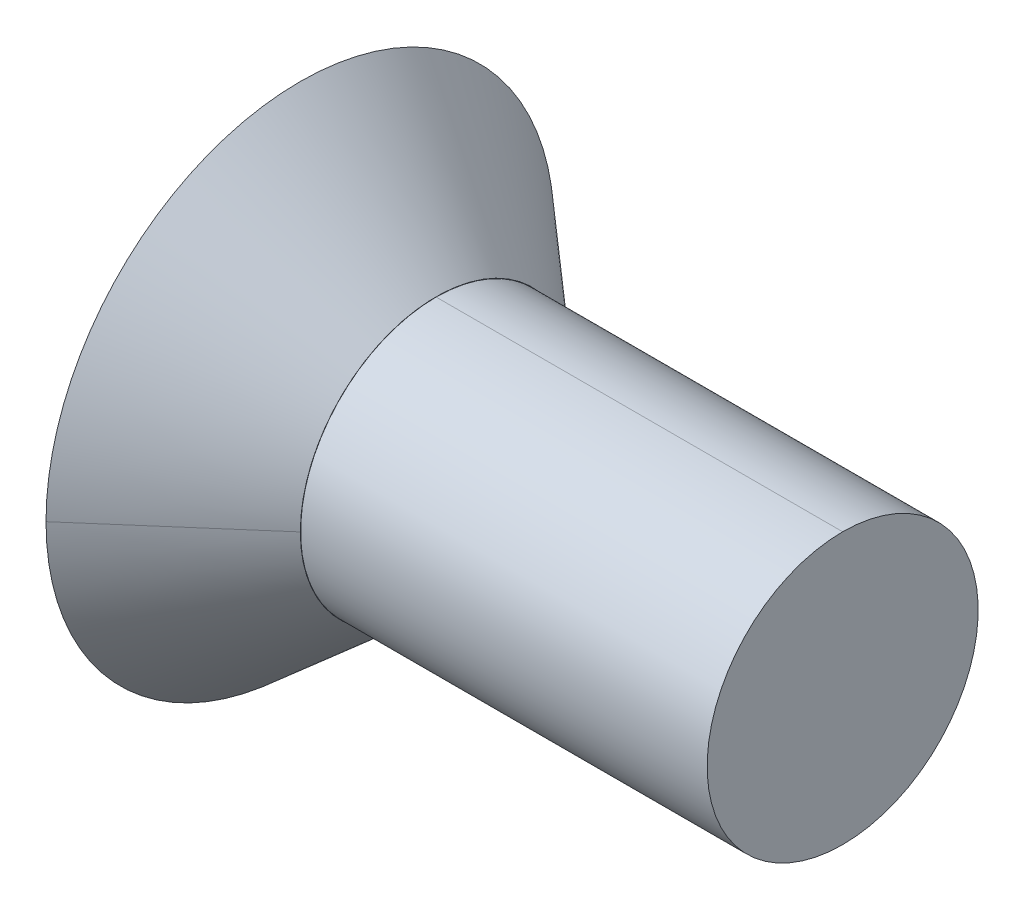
ISO-10303-21;
HEADER;
FILE_DESCRIPTION(('STEP AP214'),'2;1');
FILE_NAME('part.step','',(''),(''),'','','');
FILE_SCHEMA(('AUTOMOTIVE_DESIGN { 1 0 10303 214 1 1 1 1 }'));
ENDSEC;
DATA;
#1=APPLICATION_CONTEXT('core data for automotive mechanical design processes');
#2=APPLICATION_PROTOCOL_DEFINITION('international standard','automotive_design',2000,#1);
#3=PRODUCT_CONTEXT('',#1,'mechanical');
#4=PRODUCT('Part','Part','',(#3));
#5=PRODUCT_RELATED_PRODUCT_CATEGORY('part','',(#4));
#6=PRODUCT_DEFINITION_FORMATION('','',#4);
#7=PRODUCT_DEFINITION_CONTEXT('part definition',#1,'design');
#8=PRODUCT_DEFINITION('design','',#6,#7);
#9=PRODUCT_DEFINITION_SHAPE('','',#8);
#10=(LENGTH_UNIT() NAMED_UNIT(*) SI_UNIT(.MILLI.,.METRE.));
#11=(NAMED_UNIT(*) PLANE_ANGLE_UNIT() SI_UNIT($,.RADIAN.));
#12=(NAMED_UNIT(*) SI_UNIT($,.STERADIAN.) SOLID_ANGLE_UNIT());
#13=UNCERTAINTY_MEASURE_WITH_UNIT(LENGTH_MEASURE(1.E-05),#10,'distance_accuracy_value','');
#14=(GEOMETRIC_REPRESENTATION_CONTEXT(3) GLOBAL_UNCERTAINTY_ASSIGNED_CONTEXT((#13)) GLOBAL_UNIT_ASSIGNED_CONTEXT((#10,
#11,#12)) REPRESENTATION_CONTEXT('',''));
#15=CARTESIAN_POINT('',(0.,0.,0.));
#16=DIRECTION('',(0.,0.,1.));
#17=DIRECTION('',(1.,0.,0.));
#18=AXIS2_PLACEMENT_3D('',#15,#16,#17);
#19=CARTESIAN_POINT('',(12.7127000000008,0.,0.));
#20=DIRECTION('',(-1.,0.,0.));
#21=DIRECTION('',(0.,0.,1.));
#22=AXIS2_PLACEMENT_3D('',#19,#20,#21);
#23=PLANE('',#22);
#24=CARTESIAN_POINT('',(12.7127000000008,0.,1.80477854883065E-13));
#25=DIRECTION('',(1.,0.,0.));
#26=DIRECTION('',(0.,1.,0.));
#27=AXIS2_PLACEMENT_3D('',#24,#25,#26);
#28=CIRCLE('',#27,6.35);
#29=CARTESIAN_POINT('',(12.7127000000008,-6.35,1.81255479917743E-13));
#30=VERTEX_POINT('',#29);
#31=CARTESIAN_POINT('',(12.7127000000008,6.35,1.79700229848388E-13));
#32=VERTEX_POINT('',#31);
#33=EDGE_CURVE('E67',#30,#32,#28,.F.);
#34=ORIENTED_EDGE('',*,*,#33,.F.);
#35=CARTESIAN_POINT('',(12.7127000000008,0.,1.80477854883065E-13));
#36=DIRECTION('',(1.,0.,0.));
#37=DIRECTION('',(0.,1.,0.));
#38=AXIS2_PLACEMENT_3D('',#35,#36,#37);
#39=CIRCLE('',#38,6.35);
#40=EDGE_CURVE('E19',#32,#30,#39,.F.);
#41=ORIENTED_EDGE('',*,*,#40,.F.);
#42=EDGE_LOOP('',(#34,#41));
#43=FACE_BOUND('',#42,.T.);
#44=ADVANCED_FACE('F16',(#43),#23,.F.);
#45=CARTESIAN_POINT('',(6.36270000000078,0.,1.80477854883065E-13));
#46=DIRECTION('',(1.,0.,0.));
#47=DIRECTION('',(0.,1.,0.));
#48=AXIS2_PLACEMENT_3D('',#45,#46,#47);
#49=CYLINDRICAL_SURFACE('',#48,6.35);
#50=DIRECTION('',(1.,0.,0.));
#51=VECTOR('',#50,1.);
#52=CARTESIAN_POINT('',(6.36270000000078,6.35,1.80477854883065E-13));
#53=LINE('',#52,#51);
#54=CARTESIAN_POINT('',(-6.33729999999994,6.35,1.79700229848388E-13));
#55=VERTEX_POINT('',#54);
#56=EDGE_CURVE('E65',#32,#55,#53,.F.);
#57=ORIENTED_EDGE('',*,*,#56,.F.);
#58=ORIENTED_EDGE('',*,*,#40,.T.);
#59=DIRECTION('',(1.,0.,0.));
#60=VECTOR('',#59,1.);
#61=CARTESIAN_POINT('',(6.36270000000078,-6.35,1.81255479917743E-13));
#62=LINE('',#61,#60);
#63=CARTESIAN_POINT('',(-6.33729999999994,-6.35,1.81255479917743E-13));
#64=VERTEX_POINT('',#63);
#65=EDGE_CURVE('E62',#64,#30,#62,.T.);
#66=ORIENTED_EDGE('',*,*,#65,.F.);
#67=CARTESIAN_POINT('',(-6.33729999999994,0.,1.80477854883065E-13));
#68=DIRECTION('',(1.,0.,0.));
#69=DIRECTION('',(0.,1.,0.));
#70=AXIS2_PLACEMENT_3D('',#67,#68,#69);
#71=CIRCLE('',#70,6.35);
#72=EDGE_CURVE('E90',#55,#64,#71,.F.);
#73=ORIENTED_EDGE('',*,*,#72,.F.);
#74=EDGE_LOOP('',(#57,#58,#66,#73));
#75=FACE_BOUND('',#74,.T.);
#76=ADVANCED_FACE('F60',(#75),#49,.T.);
#77=CARTESIAN_POINT('',(6.36270000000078,0.,1.80477854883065E-13));
#78=DIRECTION('',(1.,0.,0.));
#79=DIRECTION('',(0.,1.,0.));
#80=AXIS2_PLACEMENT_3D('',#77,#78,#79);
#81=CYLINDRICAL_SURFACE('',#80,6.35);
#82=ORIENTED_EDGE('',*,*,#56,.T.);
#83=CARTESIAN_POINT('',(-6.33729999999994,0.,1.80477854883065E-13));
#84=DIRECTION('',(1.,0.,0.));
#85=DIRECTION('',(0.,1.,0.));
#86=AXIS2_PLACEMENT_3D('',#83,#84,#85);
#87=CIRCLE('',#86,6.35);
#88=EDGE_CURVE('E71',#64,#55,#87,.F.);
#89=ORIENTED_EDGE('',*,*,#88,.F.);
#90=ORIENTED_EDGE('',*,*,#65,.T.);
#91=ORIENTED_EDGE('',*,*,#33,.T.);
#92=EDGE_LOOP('',(#82,#89,#90,#91));
#93=FACE_BOUND('',#92,.T.);
#94=ADVANCED_FACE('F69',(#93),#81,.T.);
#95=CARTESIAN_POINT('',(-6.36270000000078,-3.60250718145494E-13,0.));
#96=DIRECTION('',(1.,0.,0.));
#97=DIRECTION('',(0.,0.,-1.));
#98=AXIS2_PLACEMENT_3D('',#95,#96,#97);
#99=PLANE('',#98);
#100=DIRECTION('',(0.,1.,0.));
#101=VECTOR('',#100,1.);
#102=CARTESIAN_POINT('',(-6.36270000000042,-2.29135888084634,3.96875));
#103=LINE('',#102,#101);
#104=CARTESIAN_POINT('',(-6.3627000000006,-2.29135888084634,3.96875));
#105=VERTEX_POINT('',#104);
#106=CARTESIAN_POINT('',(-6.36270000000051,2.29135888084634,3.96875));
#107=VERTEX_POINT('',#106);
#108=EDGE_CURVE('E89',#105,#107,#103,.T.);
#109=ORIENTED_EDGE('',*,*,#108,.T.);
#110=DIRECTION('',(0.,-0.500000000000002,0.866025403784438));
#111=VECTOR('',#110,1.);
#112=CARTESIAN_POINT('',(-6.36270000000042,2.29135888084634,3.96875));
#113=LINE('',#112,#111);
#114=CARTESIAN_POINT('',(-6.3627000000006,4.58271776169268,0.));
#115=VERTEX_POINT('',#114);
#116=EDGE_CURVE('E110',#107,#115,#113,.F.);
#117=ORIENTED_EDGE('',*,*,#116,.T.);
#118=DIRECTION('',(0.,0.500000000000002,0.866025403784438));
#119=VECTOR('',#118,1.);
#120=CARTESIAN_POINT('',(-6.36270000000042,4.58271776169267,0.));
#121=LINE('',#120,#119);
#122=CARTESIAN_POINT('',(-6.3627000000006,2.29135888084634,-3.96875));
#123=VERTEX_POINT('',#122);
#124=EDGE_CURVE('E119',#115,#123,#121,.F.);
#125=ORIENTED_EDGE('',*,*,#124,.T.);
#126=DIRECTION('',(0.,1.,0.));
#127=VECTOR('',#126,1.);
#128=CARTESIAN_POINT('',(-6.36270000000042,2.29135888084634,-3.96875));
#129=LINE('',#128,#127);
#130=CARTESIAN_POINT('',(-6.3627000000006,-2.29135888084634,-3.96875));
#131=VERTEX_POINT('',#130);
#132=EDGE_CURVE('E125',#123,#131,#129,.F.);
#133=ORIENTED_EDGE('',*,*,#132,.T.);
#134=DIRECTION('',(0.,0.500000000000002,-0.866025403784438));
#135=VECTOR('',#134,1.);
#136=CARTESIAN_POINT('',(-6.36270000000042,-2.29135888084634,-3.96875));
#137=LINE('',#136,#135);
#138=CARTESIAN_POINT('',(-6.3627000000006,-4.58271776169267,0.));
#139=VERTEX_POINT('',#138);
#140=EDGE_CURVE('E131',#131,#139,#137,.F.);
#141=ORIENTED_EDGE('',*,*,#140,.T.);
#142=DIRECTION('',(0.,-0.500000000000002,-0.866025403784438));
#143=VECTOR('',#142,1.);
#144=CARTESIAN_POINT('',(-6.36270000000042,-4.58271776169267,0.));
#145=LINE('',#144,#143);
#146=EDGE_CURVE('E137',#139,#105,#145,.F.);
#147=ORIENTED_EDGE('',*,*,#146,.T.);
#148=EDGE_LOOP('',(#109,#117,#125,#133,#141,#147));
#149=FACE_BOUND('',#148,.T.);
#150=ADVANCED_FACE('F96',(#149),#99,.F.);
#151=CARTESIAN_POINT('',(-6.33729999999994,0.,3.18209966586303));
#152=DIRECTION('',(1.,0.,0.));
#153=DIRECTION('',(0.,0.,-1.));
#154=AXIS2_PLACEMENT_3D('',#151,#152,#153);
#155=PLANE('',#154);
#156=ORIENTED_EDGE('',*,*,#72,.T.);
#157=ORIENTED_EDGE('',*,*,#88,.T.);
#158=EDGE_LOOP('',(#156,#157));
#159=FACE_BOUND('',#158,.T.);
#160=CARTESIAN_POINT('',(-6.33729999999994,0.,0.));
#161=DIRECTION('',(-1.,0.,0.));
#162=DIRECTION('',(0.,-1.,0.));
#163=AXIS2_PLACEMENT_3D('',#160,#161,#162);
#164=CIRCLE('',#163,6.36419933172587);
#165=CARTESIAN_POINT('',(-6.33729999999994,0.,6.36419933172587));
#166=VERTEX_POINT('',#165);
#167=CARTESIAN_POINT('',(-6.33729999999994,0.,-6.36419933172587));
#168=VERTEX_POINT('',#167);
#169=EDGE_CURVE('E84',#166,#168,#164,.T.);
#170=ORIENTED_EDGE('',*,*,#169,.F.);
#171=CARTESIAN_POINT('',(-6.33729999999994,0.,0.));
#172=DIRECTION('',(-1.,0.,0.));
#173=DIRECTION('',(0.,-1.,0.));
#174=AXIS2_PLACEMENT_3D('',#171,#172,#173);
#175=CIRCLE('',#174,6.36419933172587);
#176=EDGE_CURVE('E80',#168,#166,#175,.T.);
#177=ORIENTED_EDGE('',*,*,#176,.F.);
#178=EDGE_LOOP('',(#170,#177));
#179=FACE_BOUND('',#178,.T.);
#180=ADVANCED_FACE('F92',(#159,#179),#155,.T.);
#181=CARTESIAN_POINT('',(-6.36270000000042,-2.29135888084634,3.96875));
#182=DIRECTION('',(0.,0.,1.));
#183=DIRECTION('',(1.,0.,0.));
#184=AXIS2_PLACEMENT_3D('',#181,#182,#183);
#185=PLANE('',#184);
#186=DIRECTION('',(1.,0.,0.));
#187=VECTOR('',#186,1.);
#188=CARTESIAN_POINT('',(-6.36270000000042,2.29135888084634,3.96875));
#189=LINE('',#188,#187);
#190=CARTESIAN_POINT('',(-12.7127000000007,2.29135888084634,3.96875));
#191=VERTEX_POINT('',#190);
#192=EDGE_CURVE('E113',#191,#107,#189,.T.);
#193=ORIENTED_EDGE('',*,*,#192,.T.);
#194=ORIENTED_EDGE('',*,*,#108,.F.);
#195=DIRECTION('',(1.,0.,0.));
#196=VECTOR('',#195,1.);
#197=CARTESIAN_POINT('',(-6.36270000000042,-2.29135888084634,3.96875));
#198=LINE('',#197,#196);
#199=CARTESIAN_POINT('',(-12.7127000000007,-2.29135888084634,3.96875));
#200=VERTEX_POINT('',#199);
#201=EDGE_CURVE('E134',#105,#200,#198,.F.);
#202=ORIENTED_EDGE('',*,*,#201,.T.);
#203=DIRECTION('',(0.,1.,0.));
#204=VECTOR('',#203,1.);
#205=CARTESIAN_POINT('',(-12.7127000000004,0.,3.96875));
#206=LINE('',#205,#204);
#207=EDGE_CURVE('E83',#191,#200,#206,.F.);
#208=ORIENTED_EDGE('',*,*,#207,.F.);
#209=EDGE_LOOP('',(#193,#194,#202,#208));
#210=FACE_BOUND('',#209,.T.);
#211=ADVANCED_FACE('F95',(#210),#185,.F.);
#212=CARTESIAN_POINT('',(-6.36270000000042,-4.58271776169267,0.));
#213=DIRECTION('',(0.,-0.866025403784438,0.500000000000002));
#214=DIRECTION('',(0.,-0.500000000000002,-0.866025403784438));
#215=AXIS2_PLACEMENT_3D('',#212,#213,#214);
#216=PLANE('',#215);
#217=ORIENTED_EDGE('',*,*,#201,.F.);
#218=ORIENTED_EDGE('',*,*,#146,.F.);
#219=DIRECTION('',(1.,0.,0.));
#220=VECTOR('',#219,1.);
#221=CARTESIAN_POINT('',(-6.36270000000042,-4.58271776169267,0.));
#222=LINE('',#221,#220);
#223=CARTESIAN_POINT('',(-12.7127000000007,-4.58271776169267,0.));
#224=VERTEX_POINT('',#223);
#225=EDGE_CURVE('E128',#139,#224,#222,.F.);
#226=ORIENTED_EDGE('',*,*,#225,.T.);
#227=DIRECTION('',(0.,-0.500000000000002,-0.866025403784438));
#228=VECTOR('',#227,1.);
#229=CARTESIAN_POINT('',(-12.7127000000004,-2.29135888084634,3.96875));
#230=LINE('',#229,#228);
#231=EDGE_CURVE('E197',#200,#224,#230,.T.);
#232=ORIENTED_EDGE('',*,*,#231,.F.);
#233=EDGE_LOOP('',(#217,#218,#226,#232));
#234=FACE_BOUND('',#233,.T.);
#235=ADVANCED_FACE('F187',(#234),#216,.F.);
#236=CARTESIAN_POINT('',(-6.36270000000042,-2.29135888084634,-3.96875));
#237=DIRECTION('',(0.,-0.866025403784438,-0.500000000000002));
#238=DIRECTION('',(0.,0.500000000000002,-0.866025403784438));
#239=AXIS2_PLACEMENT_3D('',#236,#237,#238);
#240=PLANE('',#239);
#241=ORIENTED_EDGE('',*,*,#225,.F.);
#242=ORIENTED_EDGE('',*,*,#140,.F.);
#243=DIRECTION('',(-1.,0.,0.));
#244=VECTOR('',#243,1.);
#245=CARTESIAN_POINT('',(-6.36270000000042,-2.29135888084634,-3.96875));
#246=LINE('',#245,#244);
#247=CARTESIAN_POINT('',(-12.7127000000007,-2.29135888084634,-3.96875));
#248=VERTEX_POINT('',#247);
#249=EDGE_CURVE('E122',#131,#248,#246,.T.);
#250=ORIENTED_EDGE('',*,*,#249,.T.);
#251=DIRECTION('',(0.,0.500000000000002,-0.866025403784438));
#252=VECTOR('',#251,1.);
#253=CARTESIAN_POINT('',(-12.7127000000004,-4.58271776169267,0.));
#254=LINE('',#253,#252);
#255=EDGE_CURVE('E192',#224,#248,#254,.T.);
#256=ORIENTED_EDGE('',*,*,#255,.F.);
#257=EDGE_LOOP('',(#241,#242,#250,#256));
#258=FACE_BOUND('',#257,.T.);
#259=ADVANCED_FACE('F190',(#258),#240,.F.);
#260=CARTESIAN_POINT('',(-6.36270000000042,2.29135888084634,-3.96875));
#261=DIRECTION('',(0.,0.,-1.));
#262=DIRECTION('',(-1.,0.,0.));
#263=AXIS2_PLACEMENT_3D('',#260,#261,#262);
#264=PLANE('',#263);
#265=ORIENTED_EDGE('',*,*,#249,.F.);
#266=ORIENTED_EDGE('',*,*,#132,.F.);
#267=DIRECTION('',(1.,0.,0.));
#268=VECTOR('',#267,1.);
#269=CARTESIAN_POINT('',(-6.36270000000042,2.29135888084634,-3.96875));
#270=LINE('',#269,#268);
#271=CARTESIAN_POINT('',(-12.7127000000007,2.29135888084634,-3.96875));
#272=VERTEX_POINT('',#271);
#273=EDGE_CURVE('E116',#123,#272,#270,.F.);
#274=ORIENTED_EDGE('',*,*,#273,.T.);
#275=DIRECTION('',(0.,1.,0.));
#276=VECTOR('',#275,1.);
#277=CARTESIAN_POINT('',(-12.7127000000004,0.,-3.96875));
#278=LINE('',#277,#276);
#279=EDGE_CURVE('E196',#248,#272,#278,.T.);
#280=ORIENTED_EDGE('',*,*,#279,.F.);
#281=EDGE_LOOP('',(#265,#266,#274,#280));
#282=FACE_BOUND('',#281,.T.);
#283=ADVANCED_FACE('F205',(#282),#264,.F.);
#284=CARTESIAN_POINT('',(-6.36270000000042,4.58271776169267,0.));
#285=DIRECTION('',(0.,0.866025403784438,-0.500000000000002));
#286=DIRECTION('',(0.,0.500000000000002,0.866025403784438));
#287=AXIS2_PLACEMENT_3D('',#284,#285,#286);
#288=PLANE('',#287);
#289=ORIENTED_EDGE('',*,*,#273,.F.);
#290=ORIENTED_EDGE('',*,*,#124,.F.);
#291=DIRECTION('',(1.,0.,0.));
#292=VECTOR('',#291,1.);
#293=CARTESIAN_POINT('',(-6.36270000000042,4.58271776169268,0.));
#294=LINE('',#293,#292);
#295=CARTESIAN_POINT('',(-12.7127000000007,4.58271776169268,0.));
#296=VERTEX_POINT('',#295);
#297=EDGE_CURVE('E87',#115,#296,#294,.F.);
#298=ORIENTED_EDGE('',*,*,#297,.T.);
#299=DIRECTION('',(0.,0.500000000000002,0.866025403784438));
#300=VECTOR('',#299,1.);
#301=CARTESIAN_POINT('',(-12.7127000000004,2.29135888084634,-3.96875));
#302=LINE('',#301,#300);
#303=EDGE_CURVE('E165',#272,#296,#302,.T.);
#304=ORIENTED_EDGE('',*,*,#303,.F.);
#305=EDGE_LOOP('',(#289,#290,#298,#304));
#306=FACE_BOUND('',#305,.T.);
#307=ADVANCED_FACE('F163',(#306),#288,.F.);
#308=CARTESIAN_POINT('',(-6.36270000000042,2.29135888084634,3.96875));
#309=DIRECTION('',(0.,0.866025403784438,0.500000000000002));
#310=DIRECTION('',(0.,-0.500000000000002,0.866025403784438));
#311=AXIS2_PLACEMENT_3D('',#308,#309,#310);
#312=PLANE('',#311);
#313=ORIENTED_EDGE('',*,*,#297,.F.);
#314=ORIENTED_EDGE('',*,*,#116,.F.);
#315=ORIENTED_EDGE('',*,*,#192,.F.);
#316=DIRECTION('',(0.,-0.500000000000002,0.866025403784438));
#317=VECTOR('',#316,1.);
#318=CARTESIAN_POINT('',(-12.7127000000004,4.58271776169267,0.));
#319=LINE('',#318,#317);
#320=EDGE_CURVE('E79',#296,#191,#319,.T.);
#321=ORIENTED_EDGE('',*,*,#320,.F.);
#322=EDGE_LOOP('',(#313,#314,#315,#321));
#323=FACE_BOUND('',#322,.T.);
#324=ADVANCED_FACE('F157',(#323),#312,.F.);
#325=CARTESIAN_POINT('',(-12.7127000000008,0.,0.));
#326=DIRECTION('',(-1.,0.,0.));
#327=DIRECTION('',(0.,-1.,0.));
#328=AXIS2_PLACEMENT_3D('',#325,#326,#327);
#329=CONICAL_SURFACE('',#328,11.9062500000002,0.715584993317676);
#330=DIRECTION('',(0.754709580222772,0.,0.656059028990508));
#331=VECTOR('',#330,1.);
#332=CARTESIAN_POINT('',(-9.52500000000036,0.,-9.13522466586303));
#333=LINE('',#332,#331);
#334=CARTESIAN_POINT('',(-12.7127000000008,0.,-11.9062500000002));
#335=VERTEX_POINT('',#334);
#336=EDGE_CURVE('E34',#335,#168,#333,.T.);
#337=ORIENTED_EDGE('',*,*,#336,.F.);
#338=CARTESIAN_POINT('',(-12.7127000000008,0.,0.));
#339=DIRECTION('',(-1.,0.,0.));
#340=DIRECTION('',(0.,-1.,0.));
#341=AXIS2_PLACEMENT_3D('',#338,#339,#340);
#342=CIRCLE('',#341,11.9062500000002);
#343=CARTESIAN_POINT('',(-12.7127000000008,0.,11.9062500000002));
#344=VERTEX_POINT('',#343);
#345=EDGE_CURVE('E25',#344,#335,#342,.T.);
#346=ORIENTED_EDGE('',*,*,#345,.F.);
#347=DIRECTION('',(0.754709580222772,0.,-0.656059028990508));
#348=VECTOR('',#347,1.);
#349=CARTESIAN_POINT('',(-9.52500000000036,0.,9.13522466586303));
#350=LINE('',#349,#348);
#351=EDGE_CURVE('E86',#166,#344,#350,.F.);
#352=ORIENTED_EDGE('',*,*,#351,.F.);
#353=ORIENTED_EDGE('',*,*,#169,.T.);
#354=EDGE_LOOP('',(#337,#346,#352,#353));
#355=FACE_BOUND('',#354,.T.);
#356=ADVANCED_FACE('F101',(#355),#329,.T.);
#357=CARTESIAN_POINT('',(-12.7127000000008,0.,0.));
#358=DIRECTION('',(-1.,0.,0.));
#359=DIRECTION('',(0.,-1.,0.));
#360=AXIS2_PLACEMENT_3D('',#357,#358,#359);
#361=CONICAL_SURFACE('',#360,11.9062500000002,0.715584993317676);
#362=ORIENTED_EDGE('',*,*,#336,.T.);
#363=ORIENTED_EDGE('',*,*,#176,.T.);
#364=ORIENTED_EDGE('',*,*,#351,.T.);
#365=CARTESIAN_POINT('',(-12.7127000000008,0.,0.));
#366=DIRECTION('',(-1.,0.,0.));
#367=DIRECTION('',(0.,-1.,0.));
#368=AXIS2_PLACEMENT_3D('',#365,#366,#367);
#369=CIRCLE('',#368,11.9062500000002);
#370=EDGE_CURVE('E11',#335,#344,#369,.T.);
#371=ORIENTED_EDGE('',*,*,#370,.F.);
#372=EDGE_LOOP('',(#362,#363,#364,#371));
#373=FACE_BOUND('',#372,.T.);
#374=ADVANCED_FACE('F104',(#373),#361,.T.);
#375=CARTESIAN_POINT('',(-12.7127000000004,0.,5.95312500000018));
#376=DIRECTION('',(-1.,0.,0.));
#377=DIRECTION('',(0.,0.,1.));
#378=AXIS2_PLACEMENT_3D('',#375,#376,#377);
#379=PLANE('',#378);
#380=ORIENTED_EDGE('',*,*,#345,.T.);
#381=ORIENTED_EDGE('',*,*,#370,.T.);
#382=EDGE_LOOP('',(#380,#381));
#383=FACE_BOUND('',#382,.T.);
#384=ORIENTED_EDGE('',*,*,#303,.T.);
#385=ORIENTED_EDGE('',*,*,#320,.T.);
#386=ORIENTED_EDGE('',*,*,#207,.T.);
#387=ORIENTED_EDGE('',*,*,#231,.T.);
#388=ORIENTED_EDGE('',*,*,#255,.T.);
#389=ORIENTED_EDGE('',*,*,#279,.T.);
#390=EDGE_LOOP('',(#384,#385,#386,#387,#388,#389));
#391=FACE_BOUND('',#390,.T.);
#392=ADVANCED_FACE('F199',(#383,#391),#379,.T.);
#393=CLOSED_SHELL('',(#44,#76,#94,#150,#180,#211,#235,#259,#283,#307,#324,#356,#374,#392));
#394=MANIFOLD_SOLID_BREP('B1',#393);
#395=ADVANCED_BREP_SHAPE_REPRESENTATION('',(#18,#394),#14);
#396=SHAPE_DEFINITION_REPRESENTATION(#9,#395);
ENDSEC;
END-ISO-10303-21;
